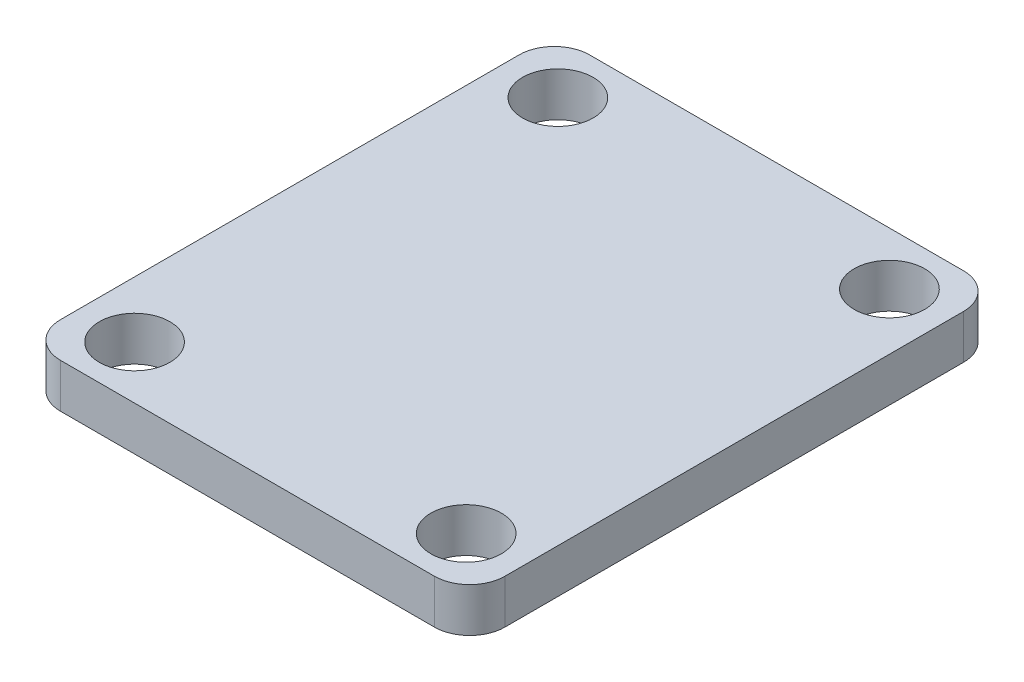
from build123d import *

# Parameters (mm, degrees)
SKETCH3_W           = 32.004
SKETCH3_H           = 38.1
BOSS_EXTRUDE1_DEPTH = 3.175
SKETCH4_R           = 2.54
CUT_EXTRUDE1_DEPTH  = 26.080811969
FILLET1_R           = 2.54


with BuildPart() as part:
    # Sketch3 → Boss-Extrude1 (new body)
    with BuildSketch(Plane(origin=(0, 0, 0), x_dir=(1, 0, 0), z_dir=(0, 1, 0))):
        Rectangle(SKETCH3_W, SKETCH3_H)
    extrude(amount=-BOSS_EXTRUDE1_DEPTH)

    # Sketch4 → Cut-Extrude1 (cut, through all)
    with BuildSketch(Plane(origin=(0, 0, 0), x_dir=(1, 0, 0), z_dir=(0, 1, 0))):
        with Locations(Location((11.938, 15.24, 0), (0, 0, 270))):
            Circle(SKETCH4_R)
        with Locations(Location((-11.938, 15.24, 0), (0, 0, 270))):
            Circle(SKETCH4_R)
        with Locations(Location((-11.938, -15.24, 0), (0, 0, 270))):
            Circle(SKETCH4_R)
        with Locations(Location((11.938, -15.24, 0), (0, 0, 270))):
            Circle(SKETCH4_R)
    extrude(amount=-CUT_EXTRUDE1_DEPTH, mode=Mode.SUBTRACT)

    # Fillet1
    fillet1_edges = [part.edges().sort_by_distance(p)[0] for p in [
        (-16.002, -1.5875, -19.05),
        (16.002, -1.5875, -19.05),
        (16.002, -1.5875, 19.05),
        (-16.002, -1.5875, 19.05),
    ]]
    fillet(fillet1_edges, radius=FILLET1_R)


solid = part.part
